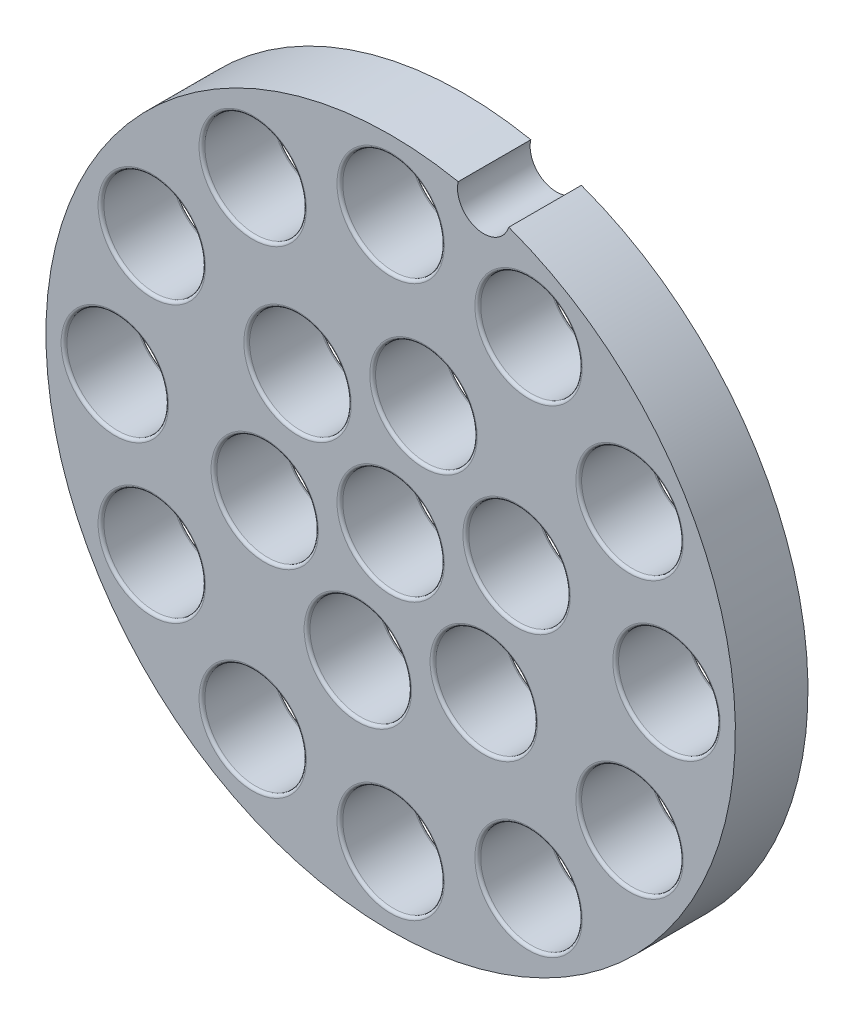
ISO-10303-21;
HEADER;
FILE_DESCRIPTION(('STEP AP214'),'2;1');
FILE_NAME('part.step','',(''),(''),'','','');
FILE_SCHEMA(('AUTOMOTIVE_DESIGN { 1 0 10303 214 1 1 1 1 }'));
ENDSEC;
DATA;
#1=APPLICATION_CONTEXT('core data for automotive mechanical design processes');
#2=APPLICATION_PROTOCOL_DEFINITION('international standard','automotive_design',2000,#1);
#3=PRODUCT_CONTEXT('',#1,'mechanical');
#4=PRODUCT('Part','Part','',(#3));
#5=PRODUCT_RELATED_PRODUCT_CATEGORY('part','',(#4));
#6=PRODUCT_DEFINITION_FORMATION('','',#4);
#7=PRODUCT_DEFINITION_CONTEXT('part definition',#1,'design');
#8=PRODUCT_DEFINITION('design','',#6,#7);
#9=PRODUCT_DEFINITION_SHAPE('','',#8);
#10=(LENGTH_UNIT() NAMED_UNIT(*) SI_UNIT(.MILLI.,.METRE.));
#11=(NAMED_UNIT(*) PLANE_ANGLE_UNIT() SI_UNIT($,.RADIAN.));
#12=(NAMED_UNIT(*) SI_UNIT($,.STERADIAN.) SOLID_ANGLE_UNIT());
#13=UNCERTAINTY_MEASURE_WITH_UNIT(LENGTH_MEASURE(1.E-05),#10,'distance_accuracy_value','');
#14=(GEOMETRIC_REPRESENTATION_CONTEXT(3) GLOBAL_UNCERTAINTY_ASSIGNED_CONTEXT((#13)) GLOBAL_UNIT_ASSIGNED_CONTEXT((#10,
#11,#12)) REPRESENTATION_CONTEXT('',''));
#15=CARTESIAN_POINT('',(0.,0.,0.));
#16=DIRECTION('',(0.,0.,1.));
#17=DIRECTION('',(1.,0.,0.));
#18=AXIS2_PLACEMENT_3D('',#15,#16,#17);
#19=CARTESIAN_POINT('',(0.,0.,5.));
#20=DIRECTION('',(0.,0.,1.));
#21=DIRECTION('',(1.,0.,0.));
#22=AXIS2_PLACEMENT_3D('',#19,#20,#21);
#23=PLANE('',#22);
#24=CARTESIAN_POINT('',(6.41463588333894,22.8636264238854,5.));
#25=DIRECTION('',(0.,0.,1.));
#26=DIRECTION('',(1.,0.,0.));
#27=AXIS2_PLACEMENT_3D('',#24,#25,#26);
#28=CIRCLE('',#27,1.80954769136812);
#29=CARTESIAN_POINT('',(4.65500103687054,23.2857023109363,5.));
#30=VERTEX_POINT('',#29);
#31=CARTESIAN_POINT('',(8.13702166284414,22.3087840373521,5.));
#32=VERTEX_POINT('',#31);
#33=EDGE_CURVE('E42',#30,#32,#28,.T.);
#34=ORIENTED_EDGE('',*,*,#33,.F.);
#35=CARTESIAN_POINT('',(0.,0.,5.));
#36=DIRECTION('',(0.,0.,1.));
#37=DIRECTION('',(1.,0.,0.));
#38=AXIS2_PLACEMENT_3D('',#35,#36,#37);
#39=CIRCLE('',#38,23.7464306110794);
#40=EDGE_CURVE('E60',#30,#32,#39,.T.);
#41=ORIENTED_EDGE('',*,*,#40,.T.);
#42=EDGE_LOOP('',(#34,#41));
#43=FACE_BOUND('',#42,.T.);
#44=CARTESIAN_POINT('',(0.,0.,5.));
#45=DIRECTION('',(0.,0.,1.));
#46=DIRECTION('',(1.,0.,0.));
#47=AXIS2_PLACEMENT_3D('',#44,#45,#46);
#48=CIRCLE('',#47,3.7);
#49=CARTESIAN_POINT('',(3.7,0.,5.));
#50=VERTEX_POINT('',#49);
#51=EDGE_CURVE('E185',#50,#50,#48,.F.);
#52=ORIENTED_EDGE('',*,*,#51,.T.);
#53=EDGE_LOOP('',(#52));
#54=FACE_BOUND('',#53,.T.);
#55=CARTESIAN_POINT('',(-6.4146358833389,6.31287941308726,5.));
#56=DIRECTION('',(0.,0.,1.));
#57=DIRECTION('',(1.,0.,0.));
#58=AXIS2_PLACEMENT_3D('',#55,#56,#57);
#59=CIRCLE('',#58,3.7);
#60=CARTESIAN_POINT('',(-2.7146358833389,6.31287941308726,5.));
#61=VERTEX_POINT('',#60);
#62=EDGE_CURVE('E188',#61,#61,#59,.F.);
#63=ORIENTED_EDGE('',*,*,#62,.T.);
#64=EDGE_LOOP('',(#63));
#65=FACE_BOUND('',#64,.T.);
#66=CARTESIAN_POINT('',(-8.67443188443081,-2.39879792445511,5.));
#67=DIRECTION('',(0.,0.,1.));
#68=DIRECTION('',(1.,0.,0.));
#69=AXIS2_PLACEMENT_3D('',#66,#67,#68);
#70=CIRCLE('',#69,3.7);
#71=CARTESIAN_POINT('',(-4.97443188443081,-2.39879792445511,5.));
#72=VERTEX_POINT('',#71);
#73=EDGE_CURVE('E191',#72,#72,#70,.F.);
#74=ORIENTED_EDGE('',*,*,#73,.T.);
#75=EDGE_LOOP('',(#74));
#76=FACE_BOUND('',#75,.T.);
#77=CARTESIAN_POINT('',(-2.25979600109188,-8.71167733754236,5.));
#78=DIRECTION('',(0.,0.,1.));
#79=DIRECTION('',(1.,0.,0.));
#80=AXIS2_PLACEMENT_3D('',#77,#78,#79);
#81=CIRCLE('',#80,3.7);
#82=CARTESIAN_POINT('',(1.44020399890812,-8.71167733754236,5.));
#83=VERTEX_POINT('',#82);
#84=EDGE_CURVE('E194',#83,#83,#81,.F.);
#85=ORIENTED_EDGE('',*,*,#84,.T.);
#86=EDGE_LOOP('',(#85));
#87=FACE_BOUND('',#86,.T.);
#88=CARTESIAN_POINT('',(6.41463588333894,-6.31287941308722,5.));
#89=DIRECTION('',(0.,0.,1.));
#90=DIRECTION('',(1.,0.,0.));
#91=AXIS2_PLACEMENT_3D('',#88,#89,#90);
#92=CIRCLE('',#91,3.7);
#93=CARTESIAN_POINT('',(10.1146358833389,-6.31287941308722,5.));
#94=VERTEX_POINT('',#93);
#95=EDGE_CURVE('E197',#94,#94,#92,.F.);
#96=ORIENTED_EDGE('',*,*,#95,.T.);
#97=EDGE_LOOP('',(#96));
#98=FACE_BOUND('',#97,.T.);
#99=CARTESIAN_POINT('',(8.67443188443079,2.39879792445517,5.));
#100=DIRECTION('',(0.,0.,1.));
#101=DIRECTION('',(1.,0.,0.));
#102=AXIS2_PLACEMENT_3D('',#99,#100,#101);
#103=CIRCLE('',#102,3.7);
#104=CARTESIAN_POINT('',(12.3744318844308,2.39879792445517,5.));
#105=VERTEX_POINT('',#104);
#106=EDGE_CURVE('E200',#105,#105,#103,.F.);
#107=ORIENTED_EDGE('',*,*,#106,.T.);
#108=EDGE_LOOP('',(#107));
#109=FACE_BOUND('',#108,.T.);
#110=CARTESIAN_POINT('',(2.25979600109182,8.71167733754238,5.));
#111=DIRECTION('',(0.,0.,1.));
#112=DIRECTION('',(1.,0.,0.));
#113=AXIS2_PLACEMENT_3D('',#110,#111,#112);
#114=CIRCLE('',#113,3.7);
#115=CARTESIAN_POINT('',(5.95979600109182,8.71167733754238,5.));
#116=VERTEX_POINT('',#115);
#117=EDGE_CURVE('E203',#116,#116,#114,.F.);
#118=ORIENTED_EDGE('',*,*,#117,.T.);
#119=EDGE_LOOP('',(#118));
#120=FACE_BOUND('',#119,.T.);
#121=CARTESIAN_POINT('',(-9.49999999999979,16.4544826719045,5.));
#122=DIRECTION('',(0.,0.,1.));
#123=DIRECTION('',(1.,0.,0.));
#124=AXIS2_PLACEMENT_3D('',#121,#122,#123);
#125=CIRCLE('',#124,3.7);
#126=CARTESIAN_POINT('',(-5.79999999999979,16.4544826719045,5.));
#127=VERTEX_POINT('',#126);
#128=EDGE_CURVE('E206',#127,#127,#125,.F.);
#129=ORIENTED_EDGE('',*,*,#128,.T.);
#130=EDGE_LOOP('',(#129));
#131=FACE_BOUND('',#130,.T.);
#132=CARTESIAN_POINT('',(-16.4544826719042,9.50000000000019,5.));
#133=DIRECTION('',(0.,0.,1.));
#134=DIRECTION('',(1.,0.,0.));
#135=AXIS2_PLACEMENT_3D('',#132,#133,#134);
#136=CIRCLE('',#135,3.7);
#137=CARTESIAN_POINT('',(-12.7544826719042,9.50000000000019,5.));
#138=VERTEX_POINT('',#137);
#139=EDGE_CURVE('E209',#138,#138,#136,.F.);
#140=ORIENTED_EDGE('',*,*,#139,.T.);
#141=EDGE_LOOP('',(#140));
#142=FACE_BOUND('',#141,.T.);
#143=CARTESIAN_POINT('',(-19.,1.99014551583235E-13,5.));
#144=DIRECTION('',(0.,0.,1.));
#145=DIRECTION('',(1.,0.,0.));
#146=AXIS2_PLACEMENT_3D('',#143,#144,#145);
#147=CIRCLE('',#146,3.7);
#148=CARTESIAN_POINT('',(-15.3,1.99014551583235E-13,5.));
#149=VERTEX_POINT('',#148);
#150=EDGE_CURVE('E212',#149,#149,#147,.F.);
#151=ORIENTED_EDGE('',*,*,#150,.T.);
#152=EDGE_LOOP('',(#151));
#153=FACE_BOUND('',#152,.T.);
#154=CARTESIAN_POINT('',(-16.4544826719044,-9.49999999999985,5.));
#155=DIRECTION('',(0.,0.,1.));
#156=DIRECTION('',(1.,0.,0.));
#157=AXIS2_PLACEMENT_3D('',#154,#155,#156);
#158=CIRCLE('',#157,3.7);
#159=CARTESIAN_POINT('',(-12.7544826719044,-9.49999999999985,5.));
#160=VERTEX_POINT('',#159);
#161=EDGE_CURVE('E215',#160,#160,#158,.F.);
#162=ORIENTED_EDGE('',*,*,#161,.T.);
#163=EDGE_LOOP('',(#162));
#164=FACE_BOUND('',#163,.T.);
#165=CARTESIAN_POINT('',(-9.50000000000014,-16.4544826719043,5.));
#166=DIRECTION('',(0.,0.,1.));
#167=DIRECTION('',(1.,0.,0.));
#168=AXIS2_PLACEMENT_3D('',#165,#166,#167);
#169=CIRCLE('',#168,3.7);
#170=CARTESIAN_POINT('',(-5.80000000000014,-16.4544826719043,5.));
#171=VERTEX_POINT('',#170);
#172=EDGE_CURVE('E218',#171,#171,#169,.F.);
#173=ORIENTED_EDGE('',*,*,#172,.T.);
#174=EDGE_LOOP('',(#173));
#175=FACE_BOUND('',#174,.T.);
#176=CARTESIAN_POINT('',(-1.32676367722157E-13,-19.,5.));
#177=DIRECTION('',(0.,0.,1.));
#178=DIRECTION('',(1.,0.,0.));
#179=AXIS2_PLACEMENT_3D('',#176,#177,#178);
#180=CIRCLE('',#179,3.7);
#181=CARTESIAN_POINT('',(3.69999999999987,-19.,5.));
#182=VERTEX_POINT('',#181);
#183=EDGE_CURVE('E221',#182,#182,#180,.F.);
#184=ORIENTED_EDGE('',*,*,#183,.T.);
#185=EDGE_LOOP('',(#184));
#186=FACE_BOUND('',#185,.T.);
#187=CARTESIAN_POINT('',(9.4999999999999,-16.4544826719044,5.));
#188=DIRECTION('',(0.,0.,1.));
#189=DIRECTION('',(1.,0.,0.));
#190=AXIS2_PLACEMENT_3D('',#187,#188,#189);
#191=CIRCLE('',#190,3.7);
#192=CARTESIAN_POINT('',(13.1999999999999,-16.4544826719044,5.));
#193=VERTEX_POINT('',#192);
#194=EDGE_CURVE('E224',#193,#193,#191,.F.);
#195=ORIENTED_EDGE('',*,*,#194,.T.);
#196=EDGE_LOOP('',(#195));
#197=FACE_BOUND('',#196,.T.);
#198=CARTESIAN_POINT('',(16.4544826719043,-9.50000000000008,5.));
#199=DIRECTION('',(0.,0.,1.));
#200=DIRECTION('',(1.,0.,0.));
#201=AXIS2_PLACEMENT_3D('',#198,#199,#200);
#202=CIRCLE('',#201,3.7);
#203=CARTESIAN_POINT('',(20.1544826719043,-9.50000000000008,5.));
#204=VERTEX_POINT('',#203);
#205=EDGE_CURVE('E227',#204,#204,#202,.F.);
#206=ORIENTED_EDGE('',*,*,#205,.T.);
#207=EDGE_LOOP('',(#206));
#208=FACE_BOUND('',#207,.T.);
#209=CARTESIAN_POINT('',(19.,0.,5.));
#210=DIRECTION('',(0.,0.,1.));
#211=DIRECTION('',(1.,0.,0.));
#212=AXIS2_PLACEMENT_3D('',#209,#210,#211);
#213=CIRCLE('',#212,3.7);
#214=CARTESIAN_POINT('',(22.7,0.,5.));
#215=VERTEX_POINT('',#214);
#216=EDGE_CURVE('E230',#215,#215,#213,.F.);
#217=ORIENTED_EDGE('',*,*,#216,.T.);
#218=EDGE_LOOP('',(#217));
#219=FACE_BOUND('',#218,.T.);
#220=CARTESIAN_POINT('',(16.4544826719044,9.49999999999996,5.));
#221=DIRECTION('',(0.,0.,1.));
#222=DIRECTION('',(1.,0.,0.));
#223=AXIS2_PLACEMENT_3D('',#220,#221,#222);
#224=CIRCLE('',#223,3.7);
#225=CARTESIAN_POINT('',(20.1544826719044,9.49999999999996,5.));
#226=VERTEX_POINT('',#225);
#227=EDGE_CURVE('E233',#226,#226,#224,.F.);
#228=ORIENTED_EDGE('',*,*,#227,.T.);
#229=EDGE_LOOP('',(#228));
#230=FACE_BOUND('',#229,.T.);
#231=CARTESIAN_POINT('',(9.50000000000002,16.4544826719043,5.));
#232=DIRECTION('',(0.,0.,1.));
#233=DIRECTION('',(1.,0.,0.));
#234=AXIS2_PLACEMENT_3D('',#231,#232,#233);
#235=CIRCLE('',#234,3.7);
#236=CARTESIAN_POINT('',(13.2,16.4544826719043,5.));
#237=VERTEX_POINT('',#236);
#238=EDGE_CURVE('E236',#237,#237,#235,.F.);
#239=ORIENTED_EDGE('',*,*,#238,.T.);
#240=EDGE_LOOP('',(#239));
#241=FACE_BOUND('',#240,.T.);
#242=CARTESIAN_POINT('',(0.,19.,5.));
#243=DIRECTION('',(0.,0.,1.));
#244=DIRECTION('',(1.,0.,0.));
#245=AXIS2_PLACEMENT_3D('',#242,#243,#244);
#246=CIRCLE('',#245,3.7);
#247=CARTESIAN_POINT('',(3.7,19.,5.));
#248=VERTEX_POINT('',#247);
#249=EDGE_CURVE('E239',#248,#248,#246,.F.);
#250=ORIENTED_EDGE('',*,*,#249,.T.);
#251=EDGE_LOOP('',(#250));
#252=FACE_BOUND('',#251,.T.);
#253=ADVANCED_FACE('F29',(#43,#54,#65,#76,#87,#98,#109,#120,#131,#142,#153,#164,#175,#186,#197,
#208,#219,#230,#241,#252),#23,.T.);
#254=CARTESIAN_POINT('',(0.,0.,0.));
#255=DIRECTION('',(0.,0.,1.));
#256=DIRECTION('',(1.,0.,0.));
#257=AXIS2_PLACEMENT_3D('',#254,#255,#256);
#258=PLANE('',#257);
#259=CARTESIAN_POINT('',(0.,0.,0.));
#260=DIRECTION('',(0.,0.,1.));
#261=DIRECTION('',(1.,0.,0.));
#262=AXIS2_PLACEMENT_3D('',#259,#260,#261);
#263=CIRCLE('',#262,3.7);
#264=CARTESIAN_POINT('',(3.7,0.,0.));
#265=VERTEX_POINT('',#264);
#266=EDGE_CURVE('E65',#265,#265,#263,.T.);
#267=ORIENTED_EDGE('',*,*,#266,.T.);
#268=EDGE_LOOP('',(#267));
#269=FACE_BOUND('',#268,.T.);
#270=CARTESIAN_POINT('',(-6.4146358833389,6.31287941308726,0.));
#271=DIRECTION('',(0.,0.,1.));
#272=DIRECTION('',(1.,0.,0.));
#273=AXIS2_PLACEMENT_3D('',#270,#271,#272);
#274=CIRCLE('',#273,3.7);
#275=CARTESIAN_POINT('',(-2.7146358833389,6.31287941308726,0.));
#276=VERTEX_POINT('',#275);
#277=EDGE_CURVE('E71',#276,#276,#274,.T.);
#278=ORIENTED_EDGE('',*,*,#277,.T.);
#279=EDGE_LOOP('',(#278));
#280=FACE_BOUND('',#279,.T.);
#281=CARTESIAN_POINT('',(-8.67443188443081,-2.39879792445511,0.));
#282=DIRECTION('',(0.,0.,1.));
#283=DIRECTION('',(1.,0.,0.));
#284=AXIS2_PLACEMENT_3D('',#281,#282,#283);
#285=CIRCLE('',#284,3.7);
#286=CARTESIAN_POINT('',(-4.97443188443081,-2.39879792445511,0.));
#287=VERTEX_POINT('',#286);
#288=EDGE_CURVE('E74',#287,#287,#285,.T.);
#289=ORIENTED_EDGE('',*,*,#288,.T.);
#290=EDGE_LOOP('',(#289));
#291=FACE_BOUND('',#290,.T.);
#292=CARTESIAN_POINT('',(-2.25979600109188,-8.71167733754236,0.));
#293=DIRECTION('',(0.,0.,1.));
#294=DIRECTION('',(1.,0.,0.));
#295=AXIS2_PLACEMENT_3D('',#292,#293,#294);
#296=CIRCLE('',#295,3.7);
#297=CARTESIAN_POINT('',(1.44020399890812,-8.71167733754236,0.));
#298=VERTEX_POINT('',#297);
#299=EDGE_CURVE('E77',#298,#298,#296,.T.);
#300=ORIENTED_EDGE('',*,*,#299,.T.);
#301=EDGE_LOOP('',(#300));
#302=FACE_BOUND('',#301,.T.);
#303=CARTESIAN_POINT('',(6.41463588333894,-6.31287941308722,0.));
#304=DIRECTION('',(0.,0.,1.));
#305=DIRECTION('',(1.,0.,0.));
#306=AXIS2_PLACEMENT_3D('',#303,#304,#305);
#307=CIRCLE('',#306,3.7);
#308=CARTESIAN_POINT('',(10.1146358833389,-6.31287941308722,0.));
#309=VERTEX_POINT('',#308);
#310=EDGE_CURVE('E80',#309,#309,#307,.T.);
#311=ORIENTED_EDGE('',*,*,#310,.T.);
#312=EDGE_LOOP('',(#311));
#313=FACE_BOUND('',#312,.T.);
#314=CARTESIAN_POINT('',(8.67443188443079,2.39879792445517,0.));
#315=DIRECTION('',(0.,0.,1.));
#316=DIRECTION('',(1.,0.,0.));
#317=AXIS2_PLACEMENT_3D('',#314,#315,#316);
#318=CIRCLE('',#317,3.7);
#319=CARTESIAN_POINT('',(12.3744318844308,2.39879792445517,0.));
#320=VERTEX_POINT('',#319);
#321=EDGE_CURVE('E83',#320,#320,#318,.T.);
#322=ORIENTED_EDGE('',*,*,#321,.T.);
#323=EDGE_LOOP('',(#322));
#324=FACE_BOUND('',#323,.T.);
#325=CARTESIAN_POINT('',(2.25979600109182,8.71167733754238,0.));
#326=DIRECTION('',(0.,0.,1.));
#327=DIRECTION('',(1.,0.,0.));
#328=AXIS2_PLACEMENT_3D('',#325,#326,#327);
#329=CIRCLE('',#328,3.7);
#330=CARTESIAN_POINT('',(5.95979600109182,8.71167733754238,0.));
#331=VERTEX_POINT('',#330);
#332=EDGE_CURVE('E86',#331,#331,#329,.T.);
#333=ORIENTED_EDGE('',*,*,#332,.T.);
#334=EDGE_LOOP('',(#333));
#335=FACE_BOUND('',#334,.T.);
#336=CARTESIAN_POINT('',(-9.49999999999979,16.4544826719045,0.));
#337=DIRECTION('',(0.,0.,1.));
#338=DIRECTION('',(1.,0.,0.));
#339=AXIS2_PLACEMENT_3D('',#336,#337,#338);
#340=CIRCLE('',#339,3.7);
#341=CARTESIAN_POINT('',(-5.79999999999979,16.4544826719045,0.));
#342=VERTEX_POINT('',#341);
#343=EDGE_CURVE('E89',#342,#342,#340,.T.);
#344=ORIENTED_EDGE('',*,*,#343,.T.);
#345=EDGE_LOOP('',(#344));
#346=FACE_BOUND('',#345,.T.);
#347=CARTESIAN_POINT('',(-16.4544826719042,9.50000000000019,0.));
#348=DIRECTION('',(0.,0.,1.));
#349=DIRECTION('',(1.,0.,0.));
#350=AXIS2_PLACEMENT_3D('',#347,#348,#349);
#351=CIRCLE('',#350,3.7);
#352=CARTESIAN_POINT('',(-12.7544826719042,9.50000000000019,0.));
#353=VERTEX_POINT('',#352);
#354=EDGE_CURVE('E92',#353,#353,#351,.T.);
#355=ORIENTED_EDGE('',*,*,#354,.T.);
#356=EDGE_LOOP('',(#355));
#357=FACE_BOUND('',#356,.T.);
#358=CARTESIAN_POINT('',(-19.,1.99014551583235E-13,0.));
#359=DIRECTION('',(0.,0.,1.));
#360=DIRECTION('',(1.,0.,0.));
#361=AXIS2_PLACEMENT_3D('',#358,#359,#360);
#362=CIRCLE('',#361,3.7);
#363=CARTESIAN_POINT('',(-15.3,1.99014551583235E-13,0.));
#364=VERTEX_POINT('',#363);
#365=EDGE_CURVE('E95',#364,#364,#362,.T.);
#366=ORIENTED_EDGE('',*,*,#365,.T.);
#367=EDGE_LOOP('',(#366));
#368=FACE_BOUND('',#367,.T.);
#369=CARTESIAN_POINT('',(-16.4544826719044,-9.49999999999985,0.));
#370=DIRECTION('',(0.,0.,1.));
#371=DIRECTION('',(1.,0.,0.));
#372=AXIS2_PLACEMENT_3D('',#369,#370,#371);
#373=CIRCLE('',#372,3.7);
#374=CARTESIAN_POINT('',(-12.7544826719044,-9.49999999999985,0.));
#375=VERTEX_POINT('',#374);
#376=EDGE_CURVE('E98',#375,#375,#373,.T.);
#377=ORIENTED_EDGE('',*,*,#376,.T.);
#378=EDGE_LOOP('',(#377));
#379=FACE_BOUND('',#378,.T.);
#380=CARTESIAN_POINT('',(-9.50000000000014,-16.4544826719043,0.));
#381=DIRECTION('',(0.,0.,1.));
#382=DIRECTION('',(1.,0.,0.));
#383=AXIS2_PLACEMENT_3D('',#380,#381,#382);
#384=CIRCLE('',#383,3.7);
#385=CARTESIAN_POINT('',(-5.80000000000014,-16.4544826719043,0.));
#386=VERTEX_POINT('',#385);
#387=EDGE_CURVE('E101',#386,#386,#384,.T.);
#388=ORIENTED_EDGE('',*,*,#387,.T.);
#389=EDGE_LOOP('',(#388));
#390=FACE_BOUND('',#389,.T.);
#391=CARTESIAN_POINT('',(-1.32676367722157E-13,-19.,0.));
#392=DIRECTION('',(0.,0.,1.));
#393=DIRECTION('',(1.,0.,0.));
#394=AXIS2_PLACEMENT_3D('',#391,#392,#393);
#395=CIRCLE('',#394,3.7);
#396=CARTESIAN_POINT('',(3.69999999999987,-19.,0.));
#397=VERTEX_POINT('',#396);
#398=EDGE_CURVE('E104',#397,#397,#395,.T.);
#399=ORIENTED_EDGE('',*,*,#398,.T.);
#400=EDGE_LOOP('',(#399));
#401=FACE_BOUND('',#400,.T.);
#402=CARTESIAN_POINT('',(9.4999999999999,-16.4544826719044,0.));
#403=DIRECTION('',(0.,0.,1.));
#404=DIRECTION('',(1.,0.,0.));
#405=AXIS2_PLACEMENT_3D('',#402,#403,#404);
#406=CIRCLE('',#405,3.7);
#407=CARTESIAN_POINT('',(13.1999999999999,-16.4544826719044,0.));
#408=VERTEX_POINT('',#407);
#409=EDGE_CURVE('E107',#408,#408,#406,.T.);
#410=ORIENTED_EDGE('',*,*,#409,.T.);
#411=EDGE_LOOP('',(#410));
#412=FACE_BOUND('',#411,.T.);
#413=CARTESIAN_POINT('',(16.4544826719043,-9.50000000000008,0.));
#414=DIRECTION('',(0.,0.,1.));
#415=DIRECTION('',(1.,0.,0.));
#416=AXIS2_PLACEMENT_3D('',#413,#414,#415);
#417=CIRCLE('',#416,3.7);
#418=CARTESIAN_POINT('',(20.1544826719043,-9.50000000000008,0.));
#419=VERTEX_POINT('',#418);
#420=EDGE_CURVE('E110',#419,#419,#417,.T.);
#421=ORIENTED_EDGE('',*,*,#420,.T.);
#422=EDGE_LOOP('',(#421));
#423=FACE_BOUND('',#422,.T.);
#424=CARTESIAN_POINT('',(19.,0.,0.));
#425=DIRECTION('',(0.,0.,1.));
#426=DIRECTION('',(1.,0.,0.));
#427=AXIS2_PLACEMENT_3D('',#424,#425,#426);
#428=CIRCLE('',#427,3.7);
#429=CARTESIAN_POINT('',(22.7,0.,0.));
#430=VERTEX_POINT('',#429);
#431=EDGE_CURVE('E113',#430,#430,#428,.T.);
#432=ORIENTED_EDGE('',*,*,#431,.T.);
#433=EDGE_LOOP('',(#432));
#434=FACE_BOUND('',#433,.T.);
#435=CARTESIAN_POINT('',(16.4544826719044,9.49999999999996,0.));
#436=DIRECTION('',(0.,0.,1.));
#437=DIRECTION('',(1.,0.,0.));
#438=AXIS2_PLACEMENT_3D('',#435,#436,#437);
#439=CIRCLE('',#438,3.7);
#440=CARTESIAN_POINT('',(20.1544826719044,9.49999999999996,0.));
#441=VERTEX_POINT('',#440);
#442=EDGE_CURVE('E116',#441,#441,#439,.T.);
#443=ORIENTED_EDGE('',*,*,#442,.T.);
#444=EDGE_LOOP('',(#443));
#445=FACE_BOUND('',#444,.T.);
#446=CARTESIAN_POINT('',(9.50000000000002,16.4544826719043,0.));
#447=DIRECTION('',(0.,0.,1.));
#448=DIRECTION('',(1.,0.,0.));
#449=AXIS2_PLACEMENT_3D('',#446,#447,#448);
#450=CIRCLE('',#449,3.7);
#451=CARTESIAN_POINT('',(13.2,16.4544826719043,0.));
#452=VERTEX_POINT('',#451);
#453=EDGE_CURVE('E119',#452,#452,#450,.T.);
#454=ORIENTED_EDGE('',*,*,#453,.T.);
#455=EDGE_LOOP('',(#454));
#456=FACE_BOUND('',#455,.T.);
#457=CARTESIAN_POINT('',(0.,19.,0.));
#458=DIRECTION('',(0.,0.,1.));
#459=DIRECTION('',(1.,0.,0.));
#460=AXIS2_PLACEMENT_3D('',#457,#458,#459);
#461=CIRCLE('',#460,3.7);
#462=CARTESIAN_POINT('',(3.7,19.,0.));
#463=VERTEX_POINT('',#462);
#464=EDGE_CURVE('E122',#463,#463,#461,.T.);
#465=ORIENTED_EDGE('',*,*,#464,.T.);
#466=EDGE_LOOP('',(#465));
#467=FACE_BOUND('',#466,.T.);
#468=CARTESIAN_POINT('',(0.,0.,0.));
#469=DIRECTION('',(0.,0.,1.));
#470=DIRECTION('',(1.,0.,0.));
#471=AXIS2_PLACEMENT_3D('',#468,#469,#470);
#472=CIRCLE('',#471,23.7464306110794);
#473=CARTESIAN_POINT('',(4.65500103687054,23.2857023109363,0.));
#474=VERTEX_POINT('',#473);
#475=CARTESIAN_POINT('',(8.13702166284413,22.3087840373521,0.));
#476=VERTEX_POINT('',#475);
#477=EDGE_CURVE('E63',#474,#476,#472,.T.);
#478=ORIENTED_EDGE('',*,*,#477,.F.);
#479=CARTESIAN_POINT('',(6.41463588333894,22.8636264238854,0.));
#480=DIRECTION('',(0.,0.,1.));
#481=DIRECTION('',(1.,0.,0.));
#482=AXIS2_PLACEMENT_3D('',#479,#480,#481);
#483=CIRCLE('',#482,1.80954769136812);
#484=EDGE_CURVE('E52',#474,#476,#483,.T.);
#485=ORIENTED_EDGE('',*,*,#484,.T.);
#486=EDGE_LOOP('',(#478,#485));
#487=FACE_BOUND('',#486,.T.);
#488=ADVANCED_FACE('F315',(#269,#280,#291,#302,#313,#324,#335,#346,#357,#368,#379,#390,#401,
#412,#423,#434,#445,#456,#467,#487),#258,.F.);
#489=CARTESIAN_POINT('',(0.,19.,0.));
#490=DIRECTION('',(0.,0.,1.));
#491=DIRECTION('',(1.,0.,0.));
#492=AXIS2_PLACEMENT_3D('',#489,#490,#491);
#493=CYLINDRICAL_SURFACE('',#492,3.5);
#494=CARTESIAN_POINT('',(0.,19.,4.8));
#495=DIRECTION('',(0.,0.,1.));
#496=DIRECTION('',(1.,0.,0.));
#497=AXIS2_PLACEMENT_3D('',#494,#495,#496);
#498=CIRCLE('',#497,3.5);
#499=CARTESIAN_POINT('',(3.5,19.,4.8));
#500=VERTEX_POINT('',#499);
#501=EDGE_CURVE('E182',#500,#500,#498,.T.);
#502=ORIENTED_EDGE('',*,*,#501,.T.);
#503=EDGE_LOOP('',(#502));
#504=FACE_BOUND('',#503,.T.);
#505=CARTESIAN_POINT('',(0.,19.,0.2));
#506=DIRECTION('',(0.,0.,1.));
#507=DIRECTION('',(1.,0.,0.));
#508=AXIS2_PLACEMENT_3D('',#505,#506,#507);
#509=CIRCLE('',#508,3.5);
#510=CARTESIAN_POINT('',(3.5,19.,0.2));
#511=VERTEX_POINT('',#510);
#512=EDGE_CURVE('E125',#511,#511,#509,.F.);
#513=ORIENTED_EDGE('',*,*,#512,.T.);
#514=EDGE_LOOP('',(#513));
#515=FACE_BOUND('',#514,.T.);
#516=ADVANCED_FACE('F319',(#504,#515),#493,.F.);
#517=CARTESIAN_POINT('',(9.50000000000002,16.4544826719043,0.));
#518=DIRECTION('',(0.,0.,1.));
#519=DIRECTION('',(1.,0.,0.));
#520=AXIS2_PLACEMENT_3D('',#517,#518,#519);
#521=CYLINDRICAL_SURFACE('',#520,3.5);
#522=CARTESIAN_POINT('',(9.50000000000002,16.4544826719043,4.8));
#523=DIRECTION('',(0.,0.,1.));
#524=DIRECTION('',(1.,0.,0.));
#525=AXIS2_PLACEMENT_3D('',#522,#523,#524);
#526=CIRCLE('',#525,3.5);
#527=CARTESIAN_POINT('',(13.,16.4544826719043,4.8));
#528=VERTEX_POINT('',#527);
#529=EDGE_CURVE('E242',#528,#528,#526,.T.);
#530=ORIENTED_EDGE('',*,*,#529,.T.);
#531=EDGE_LOOP('',(#530));
#532=FACE_BOUND('',#531,.T.);
#533=CARTESIAN_POINT('',(9.50000000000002,16.4544826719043,0.2));
#534=DIRECTION('',(0.,0.,1.));
#535=DIRECTION('',(1.,0.,0.));
#536=AXIS2_PLACEMENT_3D('',#533,#534,#535);
#537=CIRCLE('',#536,3.5);
#538=CARTESIAN_POINT('',(13.,16.4544826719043,0.2));
#539=VERTEX_POINT('',#538);
#540=EDGE_CURVE('E128',#539,#539,#537,.F.);
#541=ORIENTED_EDGE('',*,*,#540,.T.);
#542=EDGE_LOOP('',(#541));
#543=FACE_BOUND('',#542,.T.);
#544=ADVANCED_FACE('F324',(#532,#543),#521,.F.);
#545=CARTESIAN_POINT('',(16.4544826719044,9.49999999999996,0.));
#546=DIRECTION('',(0.,0.,1.));
#547=DIRECTION('',(1.,0.,0.));
#548=AXIS2_PLACEMENT_3D('',#545,#546,#547);
#549=CYLINDRICAL_SURFACE('',#548,3.5);
#550=CARTESIAN_POINT('',(16.4544826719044,9.49999999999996,4.8));
#551=DIRECTION('',(0.,0.,1.));
#552=DIRECTION('',(1.,0.,0.));
#553=AXIS2_PLACEMENT_3D('',#550,#551,#552);
#554=CIRCLE('',#553,3.5);
#555=CARTESIAN_POINT('',(19.9544826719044,9.49999999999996,4.8));
#556=VERTEX_POINT('',#555);
#557=EDGE_CURVE('E245',#556,#556,#554,.T.);
#558=ORIENTED_EDGE('',*,*,#557,.T.);
#559=EDGE_LOOP('',(#558));
#560=FACE_BOUND('',#559,.T.);
#561=CARTESIAN_POINT('',(16.4544826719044,9.49999999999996,0.2));
#562=DIRECTION('',(0.,0.,1.));
#563=DIRECTION('',(1.,0.,0.));
#564=AXIS2_PLACEMENT_3D('',#561,#562,#563);
#565=CIRCLE('',#564,3.5);
#566=CARTESIAN_POINT('',(19.9544826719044,9.49999999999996,0.2));
#567=VERTEX_POINT('',#566);
#568=EDGE_CURVE('E131',#567,#567,#565,.F.);
#569=ORIENTED_EDGE('',*,*,#568,.T.);
#570=EDGE_LOOP('',(#569));
#571=FACE_BOUND('',#570,.T.);
#572=ADVANCED_FACE('F331',(#560,#571),#549,.F.);
#573=CARTESIAN_POINT('',(19.,0.,0.));
#574=DIRECTION('',(0.,0.,1.));
#575=DIRECTION('',(1.,0.,0.));
#576=AXIS2_PLACEMENT_3D('',#573,#574,#575);
#577=CYLINDRICAL_SURFACE('',#576,3.5);
#578=CARTESIAN_POINT('',(19.,0.,4.8));
#579=DIRECTION('',(0.,0.,1.));
#580=DIRECTION('',(1.,0.,0.));
#581=AXIS2_PLACEMENT_3D('',#578,#579,#580);
#582=CIRCLE('',#581,3.5);
#583=CARTESIAN_POINT('',(22.5,0.,4.8));
#584=VERTEX_POINT('',#583);
#585=EDGE_CURVE('E248',#584,#584,#582,.T.);
#586=ORIENTED_EDGE('',*,*,#585,.T.);
#587=EDGE_LOOP('',(#586));
#588=FACE_BOUND('',#587,.T.);
#589=CARTESIAN_POINT('',(19.,0.,0.2));
#590=DIRECTION('',(0.,0.,1.));
#591=DIRECTION('',(1.,0.,0.));
#592=AXIS2_PLACEMENT_3D('',#589,#590,#591);
#593=CIRCLE('',#592,3.5);
#594=CARTESIAN_POINT('',(22.5,0.,0.2));
#595=VERTEX_POINT('',#594);
#596=EDGE_CURVE('E134',#595,#595,#593,.F.);
#597=ORIENTED_EDGE('',*,*,#596,.T.);
#598=EDGE_LOOP('',(#597));
#599=FACE_BOUND('',#598,.T.);
#600=ADVANCED_FACE('F335',(#588,#599),#577,.F.);
#601=CARTESIAN_POINT('',(16.4544826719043,-9.50000000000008,0.));
#602=DIRECTION('',(0.,0.,1.));
#603=DIRECTION('',(1.,0.,0.));
#604=AXIS2_PLACEMENT_3D('',#601,#602,#603);
#605=CYLINDRICAL_SURFACE('',#604,3.5);
#606=CARTESIAN_POINT('',(16.4544826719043,-9.50000000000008,4.8));
#607=DIRECTION('',(0.,0.,1.));
#608=DIRECTION('',(1.,0.,0.));
#609=AXIS2_PLACEMENT_3D('',#606,#607,#608);
#610=CIRCLE('',#609,3.5);
#611=CARTESIAN_POINT('',(19.9544826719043,-9.50000000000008,4.8));
#612=VERTEX_POINT('',#611);
#613=EDGE_CURVE('E251',#612,#612,#610,.T.);
#614=ORIENTED_EDGE('',*,*,#613,.T.);
#615=EDGE_LOOP('',(#614));
#616=FACE_BOUND('',#615,.T.);
#617=CARTESIAN_POINT('',(16.4544826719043,-9.50000000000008,0.2));
#618=DIRECTION('',(0.,0.,1.));
#619=DIRECTION('',(1.,0.,0.));
#620=AXIS2_PLACEMENT_3D('',#617,#618,#619);
#621=CIRCLE('',#620,3.5);
#622=CARTESIAN_POINT('',(19.9544826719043,-9.50000000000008,0.2));
#623=VERTEX_POINT('',#622);
#624=EDGE_CURVE('E137',#623,#623,#621,.F.);
#625=ORIENTED_EDGE('',*,*,#624,.T.);
#626=EDGE_LOOP('',(#625));
#627=FACE_BOUND('',#626,.T.);
#628=ADVANCED_FACE('F339',(#616,#627),#605,.F.);
#629=CARTESIAN_POINT('',(9.4999999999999,-16.4544826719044,0.));
#630=DIRECTION('',(0.,0.,1.));
#631=DIRECTION('',(1.,0.,0.));
#632=AXIS2_PLACEMENT_3D('',#629,#630,#631);
#633=CYLINDRICAL_SURFACE('',#632,3.5);
#634=CARTESIAN_POINT('',(9.4999999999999,-16.4544826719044,4.8));
#635=DIRECTION('',(0.,0.,1.));
#636=DIRECTION('',(1.,0.,0.));
#637=AXIS2_PLACEMENT_3D('',#634,#635,#636);
#638=CIRCLE('',#637,3.5);
#639=CARTESIAN_POINT('',(12.9999999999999,-16.4544826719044,4.8));
#640=VERTEX_POINT('',#639);
#641=EDGE_CURVE('E254',#640,#640,#638,.T.);
#642=ORIENTED_EDGE('',*,*,#641,.T.);
#643=EDGE_LOOP('',(#642));
#644=FACE_BOUND('',#643,.T.);
#645=CARTESIAN_POINT('',(9.4999999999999,-16.4544826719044,0.2));
#646=DIRECTION('',(0.,0.,1.));
#647=DIRECTION('',(1.,0.,0.));
#648=AXIS2_PLACEMENT_3D('',#645,#646,#647);
#649=CIRCLE('',#648,3.5);
#650=CARTESIAN_POINT('',(12.9999999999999,-16.4544826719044,0.2));
#651=VERTEX_POINT('',#650);
#652=EDGE_CURVE('E140',#651,#651,#649,.F.);
#653=ORIENTED_EDGE('',*,*,#652,.T.);
#654=EDGE_LOOP('',(#653));
#655=FACE_BOUND('',#654,.T.);
#656=ADVANCED_FACE('F343',(#644,#655),#633,.F.);
#657=CARTESIAN_POINT('',(-1.32676367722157E-13,-19.,0.));
#658=DIRECTION('',(0.,0.,1.));
#659=DIRECTION('',(1.,0.,0.));
#660=AXIS2_PLACEMENT_3D('',#657,#658,#659);
#661=CYLINDRICAL_SURFACE('',#660,3.5);
#662=CARTESIAN_POINT('',(-1.32676367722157E-13,-19.,4.8));
#663=DIRECTION('',(0.,0.,1.));
#664=DIRECTION('',(1.,0.,0.));
#665=AXIS2_PLACEMENT_3D('',#662,#663,#664);
#666=CIRCLE('',#665,3.5);
#667=CARTESIAN_POINT('',(3.49999999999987,-19.,4.8));
#668=VERTEX_POINT('',#667);
#669=EDGE_CURVE('E257',#668,#668,#666,.T.);
#670=ORIENTED_EDGE('',*,*,#669,.T.);
#671=EDGE_LOOP('',(#670));
#672=FACE_BOUND('',#671,.T.);
#673=CARTESIAN_POINT('',(-1.32676367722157E-13,-19.,0.2));
#674=DIRECTION('',(0.,0.,1.));
#675=DIRECTION('',(1.,0.,0.));
#676=AXIS2_PLACEMENT_3D('',#673,#674,#675);
#677=CIRCLE('',#676,3.5);
#678=CARTESIAN_POINT('',(3.49999999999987,-19.,0.2));
#679=VERTEX_POINT('',#678);
#680=EDGE_CURVE('E143',#679,#679,#677,.F.);
#681=ORIENTED_EDGE('',*,*,#680,.T.);
#682=EDGE_LOOP('',(#681));
#683=FACE_BOUND('',#682,.T.);
#684=ADVANCED_FACE('F347',(#672,#683),#661,.F.);
#685=CARTESIAN_POINT('',(-9.50000000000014,-16.4544826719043,0.));
#686=DIRECTION('',(0.,0.,1.));
#687=DIRECTION('',(1.,0.,0.));
#688=AXIS2_PLACEMENT_3D('',#685,#686,#687);
#689=CYLINDRICAL_SURFACE('',#688,3.5);
#690=CARTESIAN_POINT('',(-9.50000000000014,-16.4544826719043,4.8));
#691=DIRECTION('',(0.,0.,1.));
#692=DIRECTION('',(1.,0.,0.));
#693=AXIS2_PLACEMENT_3D('',#690,#691,#692);
#694=CIRCLE('',#693,3.5);
#695=CARTESIAN_POINT('',(-6.00000000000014,-16.4544826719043,4.8));
#696=VERTEX_POINT('',#695);
#697=EDGE_CURVE('E260',#696,#696,#694,.T.);
#698=ORIENTED_EDGE('',*,*,#697,.T.);
#699=EDGE_LOOP('',(#698));
#700=FACE_BOUND('',#699,.T.);
#701=CARTESIAN_POINT('',(-9.50000000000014,-16.4544826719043,0.2));
#702=DIRECTION('',(0.,0.,1.));
#703=DIRECTION('',(1.,0.,0.));
#704=AXIS2_PLACEMENT_3D('',#701,#702,#703);
#705=CIRCLE('',#704,3.5);
#706=CARTESIAN_POINT('',(-6.00000000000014,-16.4544826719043,0.2));
#707=VERTEX_POINT('',#706);
#708=EDGE_CURVE('E146',#707,#707,#705,.F.);
#709=ORIENTED_EDGE('',*,*,#708,.T.);
#710=EDGE_LOOP('',(#709));
#711=FACE_BOUND('',#710,.T.);
#712=ADVANCED_FACE('F351',(#700,#711),#689,.F.);
#713=CARTESIAN_POINT('',(-16.4544826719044,-9.49999999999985,0.));
#714=DIRECTION('',(0.,0.,1.));
#715=DIRECTION('',(1.,0.,0.));
#716=AXIS2_PLACEMENT_3D('',#713,#714,#715);
#717=CYLINDRICAL_SURFACE('',#716,3.5);
#718=CARTESIAN_POINT('',(-16.4544826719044,-9.49999999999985,4.8));
#719=DIRECTION('',(0.,0.,1.));
#720=DIRECTION('',(1.,0.,0.));
#721=AXIS2_PLACEMENT_3D('',#718,#719,#720);
#722=CIRCLE('',#721,3.5);
#723=CARTESIAN_POINT('',(-12.9544826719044,-9.49999999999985,4.8));
#724=VERTEX_POINT('',#723);
#725=EDGE_CURVE('E263',#724,#724,#722,.T.);
#726=ORIENTED_EDGE('',*,*,#725,.T.);
#727=EDGE_LOOP('',(#726));
#728=FACE_BOUND('',#727,.T.);
#729=CARTESIAN_POINT('',(-16.4544826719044,-9.49999999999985,0.2));
#730=DIRECTION('',(0.,0.,1.));
#731=DIRECTION('',(1.,0.,0.));
#732=AXIS2_PLACEMENT_3D('',#729,#730,#731);
#733=CIRCLE('',#732,3.5);
#734=CARTESIAN_POINT('',(-12.9544826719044,-9.49999999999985,0.2));
#735=VERTEX_POINT('',#734);
#736=EDGE_CURVE('E149',#735,#735,#733,.F.);
#737=ORIENTED_EDGE('',*,*,#736,.T.);
#738=EDGE_LOOP('',(#737));
#739=FACE_BOUND('',#738,.T.);
#740=ADVANCED_FACE('F355',(#728,#739),#717,.F.);
#741=CARTESIAN_POINT('',(-19.,1.99014551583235E-13,0.));
#742=DIRECTION('',(0.,0.,1.));
#743=DIRECTION('',(1.,0.,0.));
#744=AXIS2_PLACEMENT_3D('',#741,#742,#743);
#745=CYLINDRICAL_SURFACE('',#744,3.5);
#746=CARTESIAN_POINT('',(-19.,1.99014551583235E-13,4.8));
#747=DIRECTION('',(0.,0.,1.));
#748=DIRECTION('',(1.,0.,0.));
#749=AXIS2_PLACEMENT_3D('',#746,#747,#748);
#750=CIRCLE('',#749,3.5);
#751=CARTESIAN_POINT('',(-15.5,1.99014551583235E-13,4.8));
#752=VERTEX_POINT('',#751);
#753=EDGE_CURVE('E266',#752,#752,#750,.T.);
#754=ORIENTED_EDGE('',*,*,#753,.T.);
#755=EDGE_LOOP('',(#754));
#756=FACE_BOUND('',#755,.T.);
#757=CARTESIAN_POINT('',(-19.,1.99014551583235E-13,0.2));
#758=DIRECTION('',(0.,0.,1.));
#759=DIRECTION('',(1.,0.,0.));
#760=AXIS2_PLACEMENT_3D('',#757,#758,#759);
#761=CIRCLE('',#760,3.5);
#762=CARTESIAN_POINT('',(-15.5,1.99014551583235E-13,0.2));
#763=VERTEX_POINT('',#762);
#764=EDGE_CURVE('E152',#763,#763,#761,.F.);
#765=ORIENTED_EDGE('',*,*,#764,.T.);
#766=EDGE_LOOP('',(#765));
#767=FACE_BOUND('',#766,.T.);
#768=ADVANCED_FACE('F359',(#756,#767),#745,.F.);
#769=CARTESIAN_POINT('',(-16.4544826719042,9.50000000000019,0.));
#770=DIRECTION('',(0.,0.,1.));
#771=DIRECTION('',(1.,0.,0.));
#772=AXIS2_PLACEMENT_3D('',#769,#770,#771);
#773=CYLINDRICAL_SURFACE('',#772,3.5);
#774=CARTESIAN_POINT('',(-16.4544826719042,9.50000000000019,4.8));
#775=DIRECTION('',(0.,0.,1.));
#776=DIRECTION('',(1.,0.,0.));
#777=AXIS2_PLACEMENT_3D('',#774,#775,#776);
#778=CIRCLE('',#777,3.5);
#779=CARTESIAN_POINT('',(-12.9544826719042,9.50000000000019,4.8));
#780=VERTEX_POINT('',#779);
#781=EDGE_CURVE('E269',#780,#780,#778,.T.);
#782=ORIENTED_EDGE('',*,*,#781,.T.);
#783=EDGE_LOOP('',(#782));
#784=FACE_BOUND('',#783,.T.);
#785=CARTESIAN_POINT('',(-16.4544826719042,9.50000000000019,0.2));
#786=DIRECTION('',(0.,0.,1.));
#787=DIRECTION('',(1.,0.,0.));
#788=AXIS2_PLACEMENT_3D('',#785,#786,#787);
#789=CIRCLE('',#788,3.5);
#790=CARTESIAN_POINT('',(-12.9544826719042,9.50000000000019,0.2));
#791=VERTEX_POINT('',#790);
#792=EDGE_CURVE('E155',#791,#791,#789,.F.);
#793=ORIENTED_EDGE('',*,*,#792,.T.);
#794=EDGE_LOOP('',(#793));
#795=FACE_BOUND('',#794,.T.);
#796=ADVANCED_FACE('F363',(#784,#795),#773,.F.);
#797=CARTESIAN_POINT('',(-9.49999999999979,16.4544826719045,0.));
#798=DIRECTION('',(0.,0.,1.));
#799=DIRECTION('',(1.,0.,0.));
#800=AXIS2_PLACEMENT_3D('',#797,#798,#799);
#801=CYLINDRICAL_SURFACE('',#800,3.5);
#802=CARTESIAN_POINT('',(-9.49999999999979,16.4544826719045,4.8));
#803=DIRECTION('',(0.,0.,1.));
#804=DIRECTION('',(1.,0.,0.));
#805=AXIS2_PLACEMENT_3D('',#802,#803,#804);
#806=CIRCLE('',#805,3.5);
#807=CARTESIAN_POINT('',(-5.99999999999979,16.4544826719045,4.8));
#808=VERTEX_POINT('',#807);
#809=EDGE_CURVE('E272',#808,#808,#806,.T.);
#810=ORIENTED_EDGE('',*,*,#809,.T.);
#811=EDGE_LOOP('',(#810));
#812=FACE_BOUND('',#811,.T.);
#813=CARTESIAN_POINT('',(-9.49999999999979,16.4544826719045,0.2));
#814=DIRECTION('',(0.,0.,1.));
#815=DIRECTION('',(1.,0.,0.));
#816=AXIS2_PLACEMENT_3D('',#813,#814,#815);
#817=CIRCLE('',#816,3.5);
#818=CARTESIAN_POINT('',(-5.99999999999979,16.4544826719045,0.2));
#819=VERTEX_POINT('',#818);
#820=EDGE_CURVE('E158',#819,#819,#817,.F.);
#821=ORIENTED_EDGE('',*,*,#820,.T.);
#822=EDGE_LOOP('',(#821));
#823=FACE_BOUND('',#822,.T.);
#824=ADVANCED_FACE('F367',(#812,#823),#801,.F.);
#825=CARTESIAN_POINT('',(2.25979600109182,8.71167733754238,0.));
#826=DIRECTION('',(0.,0.,1.));
#827=DIRECTION('',(1.,0.,0.));
#828=AXIS2_PLACEMENT_3D('',#825,#826,#827);
#829=CYLINDRICAL_SURFACE('',#828,3.5);
#830=CARTESIAN_POINT('',(2.25979600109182,8.71167733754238,4.8));
#831=DIRECTION('',(0.,0.,1.));
#832=DIRECTION('',(1.,0.,0.));
#833=AXIS2_PLACEMENT_3D('',#830,#831,#832);
#834=CIRCLE('',#833,3.5);
#835=CARTESIAN_POINT('',(5.75979600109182,8.71167733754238,4.8));
#836=VERTEX_POINT('',#835);
#837=EDGE_CURVE('E275',#836,#836,#834,.T.);
#838=ORIENTED_EDGE('',*,*,#837,.T.);
#839=EDGE_LOOP('',(#838));
#840=FACE_BOUND('',#839,.T.);
#841=CARTESIAN_POINT('',(2.25979600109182,8.71167733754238,0.2));
#842=DIRECTION('',(0.,0.,1.));
#843=DIRECTION('',(1.,0.,0.));
#844=AXIS2_PLACEMENT_3D('',#841,#842,#843);
#845=CIRCLE('',#844,3.5);
#846=CARTESIAN_POINT('',(5.75979600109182,8.71167733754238,0.2));
#847=VERTEX_POINT('',#846);
#848=EDGE_CURVE('E161',#847,#847,#845,.F.);
#849=ORIENTED_EDGE('',*,*,#848,.T.);
#850=EDGE_LOOP('',(#849));
#851=FACE_BOUND('',#850,.T.);
#852=ADVANCED_FACE('F371',(#840,#851),#829,.F.);
#853=CARTESIAN_POINT('',(8.67443188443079,2.39879792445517,0.));
#854=DIRECTION('',(0.,0.,1.));
#855=DIRECTION('',(1.,0.,0.));
#856=AXIS2_PLACEMENT_3D('',#853,#854,#855);
#857=CYLINDRICAL_SURFACE('',#856,3.5);
#858=CARTESIAN_POINT('',(8.67443188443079,2.39879792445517,4.8));
#859=DIRECTION('',(0.,0.,1.));
#860=DIRECTION('',(1.,0.,0.));
#861=AXIS2_PLACEMENT_3D('',#858,#859,#860);
#862=CIRCLE('',#861,3.5);
#863=CARTESIAN_POINT('',(12.1744318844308,2.39879792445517,4.8));
#864=VERTEX_POINT('',#863);
#865=EDGE_CURVE('E278',#864,#864,#862,.T.);
#866=ORIENTED_EDGE('',*,*,#865,.T.);
#867=EDGE_LOOP('',(#866));
#868=FACE_BOUND('',#867,.T.);
#869=CARTESIAN_POINT('',(8.67443188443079,2.39879792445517,0.2));
#870=DIRECTION('',(0.,0.,1.));
#871=DIRECTION('',(1.,0.,0.));
#872=AXIS2_PLACEMENT_3D('',#869,#870,#871);
#873=CIRCLE('',#872,3.5);
#874=CARTESIAN_POINT('',(12.1744318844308,2.39879792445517,0.2));
#875=VERTEX_POINT('',#874);
#876=EDGE_CURVE('E164',#875,#875,#873,.F.);
#877=ORIENTED_EDGE('',*,*,#876,.T.);
#878=EDGE_LOOP('',(#877));
#879=FACE_BOUND('',#878,.T.);
#880=ADVANCED_FACE('F375',(#868,#879),#857,.F.);
#881=CARTESIAN_POINT('',(6.41463588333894,-6.31287941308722,0.));
#882=DIRECTION('',(0.,0.,1.));
#883=DIRECTION('',(1.,0.,0.));
#884=AXIS2_PLACEMENT_3D('',#881,#882,#883);
#885=CYLINDRICAL_SURFACE('',#884,3.5);
#886=CARTESIAN_POINT('',(6.41463588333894,-6.31287941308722,4.8));
#887=DIRECTION('',(0.,0.,1.));
#888=DIRECTION('',(1.,0.,0.));
#889=AXIS2_PLACEMENT_3D('',#886,#887,#888);
#890=CIRCLE('',#889,3.5);
#891=CARTESIAN_POINT('',(9.91463588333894,-6.31287941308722,4.8));
#892=VERTEX_POINT('',#891);
#893=EDGE_CURVE('E281',#892,#892,#890,.T.);
#894=ORIENTED_EDGE('',*,*,#893,.T.);
#895=EDGE_LOOP('',(#894));
#896=FACE_BOUND('',#895,.T.);
#897=CARTESIAN_POINT('',(6.41463588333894,-6.31287941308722,0.2));
#898=DIRECTION('',(0.,0.,1.));
#899=DIRECTION('',(1.,0.,0.));
#900=AXIS2_PLACEMENT_3D('',#897,#898,#899);
#901=CIRCLE('',#900,3.5);
#902=CARTESIAN_POINT('',(9.91463588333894,-6.31287941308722,0.2));
#903=VERTEX_POINT('',#902);
#904=EDGE_CURVE('E167',#903,#903,#901,.F.);
#905=ORIENTED_EDGE('',*,*,#904,.T.);
#906=EDGE_LOOP('',(#905));
#907=FACE_BOUND('',#906,.T.);
#908=ADVANCED_FACE('F379',(#896,#907),#885,.F.);
#909=CARTESIAN_POINT('',(-2.25979600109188,-8.71167733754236,0.));
#910=DIRECTION('',(0.,0.,1.));
#911=DIRECTION('',(1.,0.,0.));
#912=AXIS2_PLACEMENT_3D('',#909,#910,#911);
#913=CYLINDRICAL_SURFACE('',#912,3.5);
#914=CARTESIAN_POINT('',(-2.25979600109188,-8.71167733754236,4.8));
#915=DIRECTION('',(0.,0.,1.));
#916=DIRECTION('',(1.,0.,0.));
#917=AXIS2_PLACEMENT_3D('',#914,#915,#916);
#918=CIRCLE('',#917,3.5);
#919=CARTESIAN_POINT('',(1.24020399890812,-8.71167733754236,4.8));
#920=VERTEX_POINT('',#919);
#921=EDGE_CURVE('E284',#920,#920,#918,.T.);
#922=ORIENTED_EDGE('',*,*,#921,.T.);
#923=EDGE_LOOP('',(#922));
#924=FACE_BOUND('',#923,.T.);
#925=CARTESIAN_POINT('',(-2.25979600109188,-8.71167733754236,0.2));
#926=DIRECTION('',(0.,0.,1.));
#927=DIRECTION('',(1.,0.,0.));
#928=AXIS2_PLACEMENT_3D('',#925,#926,#927);
#929=CIRCLE('',#928,3.5);
#930=CARTESIAN_POINT('',(1.24020399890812,-8.71167733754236,0.2));
#931=VERTEX_POINT('',#930);
#932=EDGE_CURVE('E170',#931,#931,#929,.F.);
#933=ORIENTED_EDGE('',*,*,#932,.T.);
#934=EDGE_LOOP('',(#933));
#935=FACE_BOUND('',#934,.T.);
#936=ADVANCED_FACE('F383',(#924,#935),#913,.F.);
#937=CARTESIAN_POINT('',(-8.67443188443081,-2.39879792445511,0.));
#938=DIRECTION('',(0.,0.,1.));
#939=DIRECTION('',(1.,0.,0.));
#940=AXIS2_PLACEMENT_3D('',#937,#938,#939);
#941=CYLINDRICAL_SURFACE('',#940,3.5);
#942=CARTESIAN_POINT('',(-8.67443188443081,-2.39879792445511,4.8));
#943=DIRECTION('',(0.,0.,1.));
#944=DIRECTION('',(1.,0.,0.));
#945=AXIS2_PLACEMENT_3D('',#942,#943,#944);
#946=CIRCLE('',#945,3.5);
#947=CARTESIAN_POINT('',(-5.17443188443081,-2.39879792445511,4.8));
#948=VERTEX_POINT('',#947);
#949=EDGE_CURVE('E287',#948,#948,#946,.T.);
#950=ORIENTED_EDGE('',*,*,#949,.T.);
#951=EDGE_LOOP('',(#950));
#952=FACE_BOUND('',#951,.T.);
#953=CARTESIAN_POINT('',(-8.67443188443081,-2.39879792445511,0.2));
#954=DIRECTION('',(0.,0.,1.));
#955=DIRECTION('',(1.,0.,0.));
#956=AXIS2_PLACEMENT_3D('',#953,#954,#955);
#957=CIRCLE('',#956,3.5);
#958=CARTESIAN_POINT('',(-5.17443188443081,-2.39879792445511,0.2));
#959=VERTEX_POINT('',#958);
#960=EDGE_CURVE('E173',#959,#959,#957,.F.);
#961=ORIENTED_EDGE('',*,*,#960,.T.);
#962=EDGE_LOOP('',(#961));
#963=FACE_BOUND('',#962,.T.);
#964=ADVANCED_FACE('F387',(#952,#963),#941,.F.);
#965=CARTESIAN_POINT('',(-6.4146358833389,6.31287941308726,0.));
#966=DIRECTION('',(0.,0.,1.));
#967=DIRECTION('',(1.,0.,0.));
#968=AXIS2_PLACEMENT_3D('',#965,#966,#967);
#969=CYLINDRICAL_SURFACE('',#968,3.5);
#970=CARTESIAN_POINT('',(-6.4146358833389,6.31287941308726,4.8));
#971=DIRECTION('',(0.,0.,1.));
#972=DIRECTION('',(1.,0.,0.));
#973=AXIS2_PLACEMENT_3D('',#970,#971,#972);
#974=CIRCLE('',#973,3.5);
#975=CARTESIAN_POINT('',(-2.9146358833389,6.31287941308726,4.8));
#976=VERTEX_POINT('',#975);
#977=EDGE_CURVE('E290',#976,#976,#974,.T.);
#978=ORIENTED_EDGE('',*,*,#977,.T.);
#979=EDGE_LOOP('',(#978));
#980=FACE_BOUND('',#979,.T.);
#981=CARTESIAN_POINT('',(-6.4146358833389,6.31287941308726,0.2));
#982=DIRECTION('',(0.,0.,1.));
#983=DIRECTION('',(1.,0.,0.));
#984=AXIS2_PLACEMENT_3D('',#981,#982,#983);
#985=CIRCLE('',#984,3.5);
#986=CARTESIAN_POINT('',(-2.9146358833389,6.31287941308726,0.2));
#987=VERTEX_POINT('',#986);
#988=EDGE_CURVE('E176',#987,#987,#985,.F.);
#989=ORIENTED_EDGE('',*,*,#988,.T.);
#990=EDGE_LOOP('',(#989));
#991=FACE_BOUND('',#990,.T.);
#992=ADVANCED_FACE('F391',(#980,#991),#969,.F.);
#993=CARTESIAN_POINT('',(0.,0.,0.));
#994=DIRECTION('',(0.,0.,1.));
#995=DIRECTION('',(1.,0.,0.));
#996=AXIS2_PLACEMENT_3D('',#993,#994,#995);
#997=CYLINDRICAL_SURFACE('',#996,3.5);
#998=CARTESIAN_POINT('',(0.,0.,4.8));
#999=DIRECTION('',(0.,0.,1.));
#1000=DIRECTION('',(1.,0.,0.));
#1001=AXIS2_PLACEMENT_3D('',#998,#999,#1000);
#1002=CIRCLE('',#1001,3.5);
#1003=CARTESIAN_POINT('',(3.5,0.,4.8));
#1004=VERTEX_POINT('',#1003);
#1005=EDGE_CURVE('E293',#1004,#1004,#1002,.T.);
#1006=ORIENTED_EDGE('',*,*,#1005,.T.);
#1007=EDGE_LOOP('',(#1006));
#1008=FACE_BOUND('',#1007,.T.);
#1009=CARTESIAN_POINT('',(0.,0.,0.2));
#1010=DIRECTION('',(0.,0.,1.));
#1011=DIRECTION('',(1.,0.,0.));
#1012=AXIS2_PLACEMENT_3D('',#1009,#1010,#1011);
#1013=CIRCLE('',#1012,3.5);
#1014=CARTESIAN_POINT('',(3.5,0.,0.2));
#1015=VERTEX_POINT('',#1014);
#1016=EDGE_CURVE('E179',#1015,#1015,#1013,.F.);
#1017=ORIENTED_EDGE('',*,*,#1016,.T.);
#1018=EDGE_LOOP('',(#1017));
#1019=FACE_BOUND('',#1018,.T.);
#1020=ADVANCED_FACE('F297',(#1008,#1019),#997,.F.);
#1021=CARTESIAN_POINT('',(0.,19.,0.2));
#1022=DIRECTION('',(0.,0.,1.));
#1023=DIRECTION('',(1.,0.,0.));
#1024=AXIS2_PLACEMENT_3D('',#1021,#1022,#1023);
#1025=TOROIDAL_SURFACE('',#1024,3.7,0.2);
#1026=ORIENTED_EDGE('',*,*,#512,.F.);
#1027=EDGE_LOOP('',(#1026));
#1028=FACE_BOUND('',#1027,.T.);
#1029=ORIENTED_EDGE('',*,*,#464,.F.);
#1030=EDGE_LOOP('',(#1029));
#1031=FACE_BOUND('',#1030,.T.);
#1032=ADVANCED_FACE('F398',(#1028,#1031),#1025,.T.);
#1033=CARTESIAN_POINT('',(9.50000000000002,16.4544826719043,0.2));
#1034=DIRECTION('',(0.,0.,1.));
#1035=DIRECTION('',(1.,0.,0.));
#1036=AXIS2_PLACEMENT_3D('',#1033,#1034,#1035);
#1037=TOROIDAL_SURFACE('',#1036,3.7,0.2);
#1038=ORIENTED_EDGE('',*,*,#540,.F.);
#1039=EDGE_LOOP('',(#1038));
#1040=FACE_BOUND('',#1039,.T.);
#1041=ORIENTED_EDGE('',*,*,#453,.F.);
#1042=EDGE_LOOP('',(#1041));
#1043=FACE_BOUND('',#1042,.T.);
#1044=ADVANCED_FACE('F401',(#1040,#1043),#1037,.T.);
#1045=CARTESIAN_POINT('',(16.4544826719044,9.49999999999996,0.2));
#1046=DIRECTION('',(0.,0.,1.));
#1047=DIRECTION('',(1.,0.,0.));
#1048=AXIS2_PLACEMENT_3D('',#1045,#1046,#1047);
#1049=TOROIDAL_SURFACE('',#1048,3.7,0.2);
#1050=ORIENTED_EDGE('',*,*,#568,.F.);
#1051=EDGE_LOOP('',(#1050));
#1052=FACE_BOUND('',#1051,.T.);
#1053=ORIENTED_EDGE('',*,*,#442,.F.);
#1054=EDGE_LOOP('',(#1053));
#1055=FACE_BOUND('',#1054,.T.);
#1056=ADVANCED_FACE('F405',(#1052,#1055),#1049,.T.);
#1057=CARTESIAN_POINT('',(19.,0.,0.2));
#1058=DIRECTION('',(0.,0.,1.));
#1059=DIRECTION('',(1.,0.,0.));
#1060=AXIS2_PLACEMENT_3D('',#1057,#1058,#1059);
#1061=TOROIDAL_SURFACE('',#1060,3.7,0.2);
#1062=ORIENTED_EDGE('',*,*,#596,.F.);
#1063=EDGE_LOOP('',(#1062));
#1064=FACE_BOUND('',#1063,.T.);
#1065=ORIENTED_EDGE('',*,*,#431,.F.);
#1066=EDGE_LOOP('',(#1065));
#1067=FACE_BOUND('',#1066,.T.);
#1068=ADVANCED_FACE('F409',(#1064,#1067),#1061,.T.);
#1069=CARTESIAN_POINT('',(16.4544826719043,-9.50000000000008,0.2));
#1070=DIRECTION('',(0.,0.,1.));
#1071=DIRECTION('',(1.,0.,0.));
#1072=AXIS2_PLACEMENT_3D('',#1069,#1070,#1071);
#1073=TOROIDAL_SURFACE('',#1072,3.7,0.2);
#1074=ORIENTED_EDGE('',*,*,#624,.F.);
#1075=EDGE_LOOP('',(#1074));
#1076=FACE_BOUND('',#1075,.T.);
#1077=ORIENTED_EDGE('',*,*,#420,.F.);
#1078=EDGE_LOOP('',(#1077));
#1079=FACE_BOUND('',#1078,.T.);
#1080=ADVANCED_FACE('F413',(#1076,#1079),#1073,.T.);
#1081=CARTESIAN_POINT('',(9.4999999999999,-16.4544826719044,0.2));
#1082=DIRECTION('',(0.,0.,1.));
#1083=DIRECTION('',(1.,0.,0.));
#1084=AXIS2_PLACEMENT_3D('',#1081,#1082,#1083);
#1085=TOROIDAL_SURFACE('',#1084,3.7,0.2);
#1086=ORIENTED_EDGE('',*,*,#652,.F.);
#1087=EDGE_LOOP('',(#1086));
#1088=FACE_BOUND('',#1087,.T.);
#1089=ORIENTED_EDGE('',*,*,#409,.F.);
#1090=EDGE_LOOP('',(#1089));
#1091=FACE_BOUND('',#1090,.T.);
#1092=ADVANCED_FACE('F417',(#1088,#1091),#1085,.T.);
#1093=CARTESIAN_POINT('',(-1.32676367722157E-13,-19.,0.2));
#1094=DIRECTION('',(0.,0.,1.));
#1095=DIRECTION('',(1.,0.,0.));
#1096=AXIS2_PLACEMENT_3D('',#1093,#1094,#1095);
#1097=TOROIDAL_SURFACE('',#1096,3.7,0.2);
#1098=ORIENTED_EDGE('',*,*,#680,.F.);
#1099=EDGE_LOOP('',(#1098));
#1100=FACE_BOUND('',#1099,.T.);
#1101=ORIENTED_EDGE('',*,*,#398,.F.);
#1102=EDGE_LOOP('',(#1101));
#1103=FACE_BOUND('',#1102,.T.);
#1104=ADVANCED_FACE('F421',(#1100,#1103),#1097,.T.);
#1105=CARTESIAN_POINT('',(-9.50000000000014,-16.4544826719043,0.2));
#1106=DIRECTION('',(0.,0.,1.));
#1107=DIRECTION('',(1.,0.,0.));
#1108=AXIS2_PLACEMENT_3D('',#1105,#1106,#1107);
#1109=TOROIDAL_SURFACE('',#1108,3.7,0.2);
#1110=ORIENTED_EDGE('',*,*,#708,.F.);
#1111=EDGE_LOOP('',(#1110));
#1112=FACE_BOUND('',#1111,.T.);
#1113=ORIENTED_EDGE('',*,*,#387,.F.);
#1114=EDGE_LOOP('',(#1113));
#1115=FACE_BOUND('',#1114,.T.);
#1116=ADVANCED_FACE('F425',(#1112,#1115),#1109,.T.);
#1117=CARTESIAN_POINT('',(-16.4544826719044,-9.49999999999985,0.2));
#1118=DIRECTION('',(0.,0.,1.));
#1119=DIRECTION('',(1.,0.,0.));
#1120=AXIS2_PLACEMENT_3D('',#1117,#1118,#1119);
#1121=TOROIDAL_SURFACE('',#1120,3.7,0.2);
#1122=ORIENTED_EDGE('',*,*,#736,.F.);
#1123=EDGE_LOOP('',(#1122));
#1124=FACE_BOUND('',#1123,.T.);
#1125=ORIENTED_EDGE('',*,*,#376,.F.);
#1126=EDGE_LOOP('',(#1125));
#1127=FACE_BOUND('',#1126,.T.);
#1128=ADVANCED_FACE('F429',(#1124,#1127),#1121,.T.);
#1129=CARTESIAN_POINT('',(-19.,1.99014551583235E-13,0.2));
#1130=DIRECTION('',(0.,0.,1.));
#1131=DIRECTION('',(1.,0.,0.));
#1132=AXIS2_PLACEMENT_3D('',#1129,#1130,#1131);
#1133=TOROIDAL_SURFACE('',#1132,3.7,0.2);
#1134=ORIENTED_EDGE('',*,*,#764,.F.);
#1135=EDGE_LOOP('',(#1134));
#1136=FACE_BOUND('',#1135,.T.);
#1137=ORIENTED_EDGE('',*,*,#365,.F.);
#1138=EDGE_LOOP('',(#1137));
#1139=FACE_BOUND('',#1138,.T.);
#1140=ADVANCED_FACE('F433',(#1136,#1139),#1133,.T.);
#1141=CARTESIAN_POINT('',(-16.4544826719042,9.50000000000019,0.2));
#1142=DIRECTION('',(0.,0.,1.));
#1143=DIRECTION('',(1.,0.,0.));
#1144=AXIS2_PLACEMENT_3D('',#1141,#1142,#1143);
#1145=TOROIDAL_SURFACE('',#1144,3.7,0.2);
#1146=ORIENTED_EDGE('',*,*,#792,.F.);
#1147=EDGE_LOOP('',(#1146));
#1148=FACE_BOUND('',#1147,.T.);
#1149=ORIENTED_EDGE('',*,*,#354,.F.);
#1150=EDGE_LOOP('',(#1149));
#1151=FACE_BOUND('',#1150,.T.);
#1152=ADVANCED_FACE('F437',(#1148,#1151),#1145,.T.);
#1153=CARTESIAN_POINT('',(-9.49999999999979,16.4544826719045,0.2));
#1154=DIRECTION('',(0.,0.,1.));
#1155=DIRECTION('',(1.,0.,0.));
#1156=AXIS2_PLACEMENT_3D('',#1153,#1154,#1155);
#1157=TOROIDAL_SURFACE('',#1156,3.7,0.2);
#1158=ORIENTED_EDGE('',*,*,#820,.F.);
#1159=EDGE_LOOP('',(#1158));
#1160=FACE_BOUND('',#1159,.T.);
#1161=ORIENTED_EDGE('',*,*,#343,.F.);
#1162=EDGE_LOOP('',(#1161));
#1163=FACE_BOUND('',#1162,.T.);
#1164=ADVANCED_FACE('F441',(#1160,#1163),#1157,.T.);
#1165=CARTESIAN_POINT('',(2.25979600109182,8.71167733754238,0.2));
#1166=DIRECTION('',(0.,0.,1.));
#1167=DIRECTION('',(1.,0.,0.));
#1168=AXIS2_PLACEMENT_3D('',#1165,#1166,#1167);
#1169=TOROIDAL_SURFACE('',#1168,3.7,0.2);
#1170=ORIENTED_EDGE('',*,*,#848,.F.);
#1171=EDGE_LOOP('',(#1170));
#1172=FACE_BOUND('',#1171,.T.);
#1173=ORIENTED_EDGE('',*,*,#332,.F.);
#1174=EDGE_LOOP('',(#1173));
#1175=FACE_BOUND('',#1174,.T.);
#1176=ADVANCED_FACE('F445',(#1172,#1175),#1169,.T.);
#1177=CARTESIAN_POINT('',(8.67443188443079,2.39879792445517,0.2));
#1178=DIRECTION('',(0.,0.,1.));
#1179=DIRECTION('',(1.,0.,0.));
#1180=AXIS2_PLACEMENT_3D('',#1177,#1178,#1179);
#1181=TOROIDAL_SURFACE('',#1180,3.7,0.2);
#1182=ORIENTED_EDGE('',*,*,#876,.F.);
#1183=EDGE_LOOP('',(#1182));
#1184=FACE_BOUND('',#1183,.T.);
#1185=ORIENTED_EDGE('',*,*,#321,.F.);
#1186=EDGE_LOOP('',(#1185));
#1187=FACE_BOUND('',#1186,.T.);
#1188=ADVANCED_FACE('F449',(#1184,#1187),#1181,.T.);
#1189=CARTESIAN_POINT('',(6.41463588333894,-6.31287941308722,0.2));
#1190=DIRECTION('',(0.,0.,1.));
#1191=DIRECTION('',(1.,0.,0.));
#1192=AXIS2_PLACEMENT_3D('',#1189,#1190,#1191);
#1193=TOROIDAL_SURFACE('',#1192,3.7,0.2);
#1194=ORIENTED_EDGE('',*,*,#904,.F.);
#1195=EDGE_LOOP('',(#1194));
#1196=FACE_BOUND('',#1195,.T.);
#1197=ORIENTED_EDGE('',*,*,#310,.F.);
#1198=EDGE_LOOP('',(#1197));
#1199=FACE_BOUND('',#1198,.T.);
#1200=ADVANCED_FACE('F453',(#1196,#1199),#1193,.T.);
#1201=CARTESIAN_POINT('',(-2.25979600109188,-8.71167733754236,0.2));
#1202=DIRECTION('',(0.,0.,1.));
#1203=DIRECTION('',(1.,0.,0.));
#1204=AXIS2_PLACEMENT_3D('',#1201,#1202,#1203);
#1205=TOROIDAL_SURFACE('',#1204,3.7,0.2);
#1206=ORIENTED_EDGE('',*,*,#932,.F.);
#1207=EDGE_LOOP('',(#1206));
#1208=FACE_BOUND('',#1207,.T.);
#1209=ORIENTED_EDGE('',*,*,#299,.F.);
#1210=EDGE_LOOP('',(#1209));
#1211=FACE_BOUND('',#1210,.T.);
#1212=ADVANCED_FACE('F457',(#1208,#1211),#1205,.T.);
#1213=CARTESIAN_POINT('',(-8.67443188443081,-2.39879792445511,0.2));
#1214=DIRECTION('',(0.,0.,1.));
#1215=DIRECTION('',(1.,0.,0.));
#1216=AXIS2_PLACEMENT_3D('',#1213,#1214,#1215);
#1217=TOROIDAL_SURFACE('',#1216,3.7,0.2);
#1218=ORIENTED_EDGE('',*,*,#960,.F.);
#1219=EDGE_LOOP('',(#1218));
#1220=FACE_BOUND('',#1219,.T.);
#1221=ORIENTED_EDGE('',*,*,#288,.F.);
#1222=EDGE_LOOP('',(#1221));
#1223=FACE_BOUND('',#1222,.T.);
#1224=ADVANCED_FACE('F461',(#1220,#1223),#1217,.T.);
#1225=CARTESIAN_POINT('',(-6.4146358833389,6.31287941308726,0.2));
#1226=DIRECTION('',(0.,0.,1.));
#1227=DIRECTION('',(1.,0.,0.));
#1228=AXIS2_PLACEMENT_3D('',#1225,#1226,#1227);
#1229=TOROIDAL_SURFACE('',#1228,3.7,0.2);
#1230=ORIENTED_EDGE('',*,*,#988,.F.);
#1231=EDGE_LOOP('',(#1230));
#1232=FACE_BOUND('',#1231,.T.);
#1233=ORIENTED_EDGE('',*,*,#277,.F.);
#1234=EDGE_LOOP('',(#1233));
#1235=FACE_BOUND('',#1234,.T.);
#1236=ADVANCED_FACE('F465',(#1232,#1235),#1229,.T.);
#1237=CARTESIAN_POINT('',(0.,0.,0.2));
#1238=DIRECTION('',(0.,0.,1.));
#1239=DIRECTION('',(1.,0.,0.));
#1240=AXIS2_PLACEMENT_3D('',#1237,#1238,#1239);
#1241=TOROIDAL_SURFACE('',#1240,3.7,0.2);
#1242=ORIENTED_EDGE('',*,*,#1016,.F.);
#1243=EDGE_LOOP('',(#1242));
#1244=FACE_BOUND('',#1243,.T.);
#1245=ORIENTED_EDGE('',*,*,#266,.F.);
#1246=EDGE_LOOP('',(#1245));
#1247=FACE_BOUND('',#1246,.T.);
#1248=ADVANCED_FACE('F469',(#1244,#1247),#1241,.T.);
#1249=CARTESIAN_POINT('',(0.,19.,4.8));
#1250=DIRECTION('',(0.,0.,1.));
#1251=DIRECTION('',(1.,0.,0.));
#1252=AXIS2_PLACEMENT_3D('',#1249,#1250,#1251);
#1253=TOROIDAL_SURFACE('',#1252,3.7,0.2);
#1254=ORIENTED_EDGE('',*,*,#249,.F.);
#1255=EDGE_LOOP('',(#1254));
#1256=FACE_BOUND('',#1255,.T.);
#1257=ORIENTED_EDGE('',*,*,#501,.F.);
#1258=EDGE_LOOP('',(#1257));
#1259=FACE_BOUND('',#1258,.T.);
#1260=ADVANCED_FACE('F473',(#1256,#1259),#1253,.T.);
#1261=CARTESIAN_POINT('',(9.50000000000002,16.4544826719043,4.8));
#1262=DIRECTION('',(0.,0.,1.));
#1263=DIRECTION('',(1.,0.,0.));
#1264=AXIS2_PLACEMENT_3D('',#1261,#1262,#1263);
#1265=TOROIDAL_SURFACE('',#1264,3.7,0.2);
#1266=ORIENTED_EDGE('',*,*,#238,.F.);
#1267=EDGE_LOOP('',(#1266));
#1268=FACE_BOUND('',#1267,.T.);
#1269=ORIENTED_EDGE('',*,*,#529,.F.);
#1270=EDGE_LOOP('',(#1269));
#1271=FACE_BOUND('',#1270,.T.);
#1272=ADVANCED_FACE('F477',(#1268,#1271),#1265,.T.);
#1273=CARTESIAN_POINT('',(16.4544826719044,9.49999999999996,4.8));
#1274=DIRECTION('',(0.,0.,1.));
#1275=DIRECTION('',(1.,0.,0.));
#1276=AXIS2_PLACEMENT_3D('',#1273,#1274,#1275);
#1277=TOROIDAL_SURFACE('',#1276,3.7,0.2);
#1278=ORIENTED_EDGE('',*,*,#227,.F.);
#1279=EDGE_LOOP('',(#1278));
#1280=FACE_BOUND('',#1279,.T.);
#1281=ORIENTED_EDGE('',*,*,#557,.F.);
#1282=EDGE_LOOP('',(#1281));
#1283=FACE_BOUND('',#1282,.T.);
#1284=ADVANCED_FACE('F481',(#1280,#1283),#1277,.T.);
#1285=CARTESIAN_POINT('',(19.,0.,4.8));
#1286=DIRECTION('',(0.,0.,1.));
#1287=DIRECTION('',(1.,0.,0.));
#1288=AXIS2_PLACEMENT_3D('',#1285,#1286,#1287);
#1289=TOROIDAL_SURFACE('',#1288,3.7,0.2);
#1290=ORIENTED_EDGE('',*,*,#216,.F.);
#1291=EDGE_LOOP('',(#1290));
#1292=FACE_BOUND('',#1291,.T.);
#1293=ORIENTED_EDGE('',*,*,#585,.F.);
#1294=EDGE_LOOP('',(#1293));
#1295=FACE_BOUND('',#1294,.T.);
#1296=ADVANCED_FACE('F485',(#1292,#1295),#1289,.T.);
#1297=CARTESIAN_POINT('',(16.4544826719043,-9.50000000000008,4.8));
#1298=DIRECTION('',(0.,0.,1.));
#1299=DIRECTION('',(1.,0.,0.));
#1300=AXIS2_PLACEMENT_3D('',#1297,#1298,#1299);
#1301=TOROIDAL_SURFACE('',#1300,3.7,0.2);
#1302=ORIENTED_EDGE('',*,*,#205,.F.);
#1303=EDGE_LOOP('',(#1302));
#1304=FACE_BOUND('',#1303,.T.);
#1305=ORIENTED_EDGE('',*,*,#613,.F.);
#1306=EDGE_LOOP('',(#1305));
#1307=FACE_BOUND('',#1306,.T.);
#1308=ADVANCED_FACE('F489',(#1304,#1307),#1301,.T.);
#1309=CARTESIAN_POINT('',(9.4999999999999,-16.4544826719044,4.8));
#1310=DIRECTION('',(0.,0.,1.));
#1311=DIRECTION('',(1.,0.,0.));
#1312=AXIS2_PLACEMENT_3D('',#1309,#1310,#1311);
#1313=TOROIDAL_SURFACE('',#1312,3.7,0.2);
#1314=ORIENTED_EDGE('',*,*,#194,.F.);
#1315=EDGE_LOOP('',(#1314));
#1316=FACE_BOUND('',#1315,.T.);
#1317=ORIENTED_EDGE('',*,*,#641,.F.);
#1318=EDGE_LOOP('',(#1317));
#1319=FACE_BOUND('',#1318,.T.);
#1320=ADVANCED_FACE('F493',(#1316,#1319),#1313,.T.);
#1321=CARTESIAN_POINT('',(-1.32676367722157E-13,-19.,4.8));
#1322=DIRECTION('',(0.,0.,1.));
#1323=DIRECTION('',(1.,0.,0.));
#1324=AXIS2_PLACEMENT_3D('',#1321,#1322,#1323);
#1325=TOROIDAL_SURFACE('',#1324,3.7,0.2);
#1326=ORIENTED_EDGE('',*,*,#183,.F.);
#1327=EDGE_LOOP('',(#1326));
#1328=FACE_BOUND('',#1327,.T.);
#1329=ORIENTED_EDGE('',*,*,#669,.F.);
#1330=EDGE_LOOP('',(#1329));
#1331=FACE_BOUND('',#1330,.T.);
#1332=ADVANCED_FACE('F497',(#1328,#1331),#1325,.T.);
#1333=CARTESIAN_POINT('',(-9.50000000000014,-16.4544826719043,4.8));
#1334=DIRECTION('',(0.,0.,1.));
#1335=DIRECTION('',(1.,0.,0.));
#1336=AXIS2_PLACEMENT_3D('',#1333,#1334,#1335);
#1337=TOROIDAL_SURFACE('',#1336,3.7,0.2);
#1338=ORIENTED_EDGE('',*,*,#172,.F.);
#1339=EDGE_LOOP('',(#1338));
#1340=FACE_BOUND('',#1339,.T.);
#1341=ORIENTED_EDGE('',*,*,#697,.F.);
#1342=EDGE_LOOP('',(#1341));
#1343=FACE_BOUND('',#1342,.T.);
#1344=ADVANCED_FACE('F501',(#1340,#1343),#1337,.T.);
#1345=CARTESIAN_POINT('',(-16.4544826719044,-9.49999999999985,4.8));
#1346=DIRECTION('',(0.,0.,1.));
#1347=DIRECTION('',(1.,0.,0.));
#1348=AXIS2_PLACEMENT_3D('',#1345,#1346,#1347);
#1349=TOROIDAL_SURFACE('',#1348,3.7,0.2);
#1350=ORIENTED_EDGE('',*,*,#161,.F.);
#1351=EDGE_LOOP('',(#1350));
#1352=FACE_BOUND('',#1351,.T.);
#1353=ORIENTED_EDGE('',*,*,#725,.F.);
#1354=EDGE_LOOP('',(#1353));
#1355=FACE_BOUND('',#1354,.T.);
#1356=ADVANCED_FACE('F505',(#1352,#1355),#1349,.T.);
#1357=CARTESIAN_POINT('',(-19.,1.99014551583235E-13,4.8));
#1358=DIRECTION('',(0.,0.,1.));
#1359=DIRECTION('',(1.,0.,0.));
#1360=AXIS2_PLACEMENT_3D('',#1357,#1358,#1359);
#1361=TOROIDAL_SURFACE('',#1360,3.7,0.2);
#1362=ORIENTED_EDGE('',*,*,#150,.F.);
#1363=EDGE_LOOP('',(#1362));
#1364=FACE_BOUND('',#1363,.T.);
#1365=ORIENTED_EDGE('',*,*,#753,.F.);
#1366=EDGE_LOOP('',(#1365));
#1367=FACE_BOUND('',#1366,.T.);
#1368=ADVANCED_FACE('F509',(#1364,#1367),#1361,.T.);
#1369=CARTESIAN_POINT('',(-16.4544826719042,9.50000000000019,4.8));
#1370=DIRECTION('',(0.,0.,1.));
#1371=DIRECTION('',(1.,0.,0.));
#1372=AXIS2_PLACEMENT_3D('',#1369,#1370,#1371);
#1373=TOROIDAL_SURFACE('',#1372,3.7,0.2);
#1374=ORIENTED_EDGE('',*,*,#139,.F.);
#1375=EDGE_LOOP('',(#1374));
#1376=FACE_BOUND('',#1375,.T.);
#1377=ORIENTED_EDGE('',*,*,#781,.F.);
#1378=EDGE_LOOP('',(#1377));
#1379=FACE_BOUND('',#1378,.T.);
#1380=ADVANCED_FACE('F513',(#1376,#1379),#1373,.T.);
#1381=CARTESIAN_POINT('',(-9.49999999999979,16.4544826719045,4.8));
#1382=DIRECTION('',(0.,0.,1.));
#1383=DIRECTION('',(1.,0.,0.));
#1384=AXIS2_PLACEMENT_3D('',#1381,#1382,#1383);
#1385=TOROIDAL_SURFACE('',#1384,3.7,0.2);
#1386=ORIENTED_EDGE('',*,*,#128,.F.);
#1387=EDGE_LOOP('',(#1386));
#1388=FACE_BOUND('',#1387,.T.);
#1389=ORIENTED_EDGE('',*,*,#809,.F.);
#1390=EDGE_LOOP('',(#1389));
#1391=FACE_BOUND('',#1390,.T.);
#1392=ADVANCED_FACE('F517',(#1388,#1391),#1385,.T.);
#1393=CARTESIAN_POINT('',(2.25979600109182,8.71167733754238,4.8));
#1394=DIRECTION('',(0.,0.,1.));
#1395=DIRECTION('',(1.,0.,0.));
#1396=AXIS2_PLACEMENT_3D('',#1393,#1394,#1395);
#1397=TOROIDAL_SURFACE('',#1396,3.7,0.2);
#1398=ORIENTED_EDGE('',*,*,#117,.F.);
#1399=EDGE_LOOP('',(#1398));
#1400=FACE_BOUND('',#1399,.T.);
#1401=ORIENTED_EDGE('',*,*,#837,.F.);
#1402=EDGE_LOOP('',(#1401));
#1403=FACE_BOUND('',#1402,.T.);
#1404=ADVANCED_FACE('F521',(#1400,#1403),#1397,.T.);
#1405=CARTESIAN_POINT('',(8.67443188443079,2.39879792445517,4.8));
#1406=DIRECTION('',(0.,0.,1.));
#1407=DIRECTION('',(1.,0.,0.));
#1408=AXIS2_PLACEMENT_3D('',#1405,#1406,#1407);
#1409=TOROIDAL_SURFACE('',#1408,3.7,0.2);
#1410=ORIENTED_EDGE('',*,*,#106,.F.);
#1411=EDGE_LOOP('',(#1410));
#1412=FACE_BOUND('',#1411,.T.);
#1413=ORIENTED_EDGE('',*,*,#865,.F.);
#1414=EDGE_LOOP('',(#1413));
#1415=FACE_BOUND('',#1414,.T.);
#1416=ADVANCED_FACE('F525',(#1412,#1415),#1409,.T.);
#1417=CARTESIAN_POINT('',(6.41463588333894,-6.31287941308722,4.8));
#1418=DIRECTION('',(0.,0.,1.));
#1419=DIRECTION('',(1.,0.,0.));
#1420=AXIS2_PLACEMENT_3D('',#1417,#1418,#1419);
#1421=TOROIDAL_SURFACE('',#1420,3.7,0.2);
#1422=ORIENTED_EDGE('',*,*,#95,.F.);
#1423=EDGE_LOOP('',(#1422));
#1424=FACE_BOUND('',#1423,.T.);
#1425=ORIENTED_EDGE('',*,*,#893,.F.);
#1426=EDGE_LOOP('',(#1425));
#1427=FACE_BOUND('',#1426,.T.);
#1428=ADVANCED_FACE('F529',(#1424,#1427),#1421,.T.);
#1429=CARTESIAN_POINT('',(-2.25979600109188,-8.71167733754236,4.8));
#1430=DIRECTION('',(0.,0.,1.));
#1431=DIRECTION('',(1.,0.,0.));
#1432=AXIS2_PLACEMENT_3D('',#1429,#1430,#1431);
#1433=TOROIDAL_SURFACE('',#1432,3.7,0.2);
#1434=ORIENTED_EDGE('',*,*,#84,.F.);
#1435=EDGE_LOOP('',(#1434));
#1436=FACE_BOUND('',#1435,.T.);
#1437=ORIENTED_EDGE('',*,*,#921,.F.);
#1438=EDGE_LOOP('',(#1437));
#1439=FACE_BOUND('',#1438,.T.);
#1440=ADVANCED_FACE('F533',(#1436,#1439),#1433,.T.);
#1441=CARTESIAN_POINT('',(-8.67443188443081,-2.39879792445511,4.8));
#1442=DIRECTION('',(0.,0.,1.));
#1443=DIRECTION('',(1.,0.,0.));
#1444=AXIS2_PLACEMENT_3D('',#1441,#1442,#1443);
#1445=TOROIDAL_SURFACE('',#1444,3.7,0.2);
#1446=ORIENTED_EDGE('',*,*,#73,.F.);
#1447=EDGE_LOOP('',(#1446));
#1448=FACE_BOUND('',#1447,.T.);
#1449=ORIENTED_EDGE('',*,*,#949,.F.);
#1450=EDGE_LOOP('',(#1449));
#1451=FACE_BOUND('',#1450,.T.);
#1452=ADVANCED_FACE('F310',(#1448,#1451),#1445,.T.);
#1453=CARTESIAN_POINT('',(-6.4146358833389,6.31287941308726,4.8));
#1454=DIRECTION('',(0.,0.,1.));
#1455=DIRECTION('',(1.,0.,0.));
#1456=AXIS2_PLACEMENT_3D('',#1453,#1454,#1455);
#1457=TOROIDAL_SURFACE('',#1456,3.7,0.2);
#1458=ORIENTED_EDGE('',*,*,#62,.F.);
#1459=EDGE_LOOP('',(#1458));
#1460=FACE_BOUND('',#1459,.T.);
#1461=ORIENTED_EDGE('',*,*,#977,.F.);
#1462=EDGE_LOOP('',(#1461));
#1463=FACE_BOUND('',#1462,.T.);
#1464=ADVANCED_FACE('F302',(#1460,#1463),#1457,.T.);
#1465=CARTESIAN_POINT('',(0.,0.,4.8));
#1466=DIRECTION('',(0.,0.,1.));
#1467=DIRECTION('',(1.,0.,0.));
#1468=AXIS2_PLACEMENT_3D('',#1465,#1466,#1467);
#1469=TOROIDAL_SURFACE('',#1468,3.7,0.2);
#1470=ORIENTED_EDGE('',*,*,#51,.F.);
#1471=EDGE_LOOP('',(#1470));
#1472=FACE_BOUND('',#1471,.T.);
#1473=ORIENTED_EDGE('',*,*,#1005,.F.);
#1474=EDGE_LOOP('',(#1473));
#1475=FACE_BOUND('',#1474,.T.);
#1476=ADVANCED_FACE('F300',(#1472,#1475),#1469,.T.);
#1477=CARTESIAN_POINT('',(0.,0.,0.));
#1478=DIRECTION('',(0.,0.,1.));
#1479=DIRECTION('',(1.,0.,0.));
#1480=AXIS2_PLACEMENT_3D('',#1477,#1478,#1479);
#1481=CYLINDRICAL_SURFACE('',#1480,23.7464306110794);
#1482=DIRECTION('',(0.,0.,1.));
#1483=VECTOR('',#1482,1.);
#1484=CARTESIAN_POINT('',(4.65500103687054,23.2857023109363,2.5));
#1485=LINE('',#1484,#1483);
#1486=EDGE_CURVE('E11',#474,#30,#1485,.T.);
#1487=ORIENTED_EDGE('',*,*,#1486,.F.);
#1488=ORIENTED_EDGE('',*,*,#477,.T.);
#1489=DIRECTION('',(0.,0.,1.));
#1490=VECTOR('',#1489,1.);
#1491=CARTESIAN_POINT('',(8.13702166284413,22.3087840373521,2.5));
#1492=LINE('',#1491,#1490);
#1493=EDGE_CURVE('E36',#32,#476,#1492,.F.);
#1494=ORIENTED_EDGE('',*,*,#1493,.F.);
#1495=ORIENTED_EDGE('',*,*,#40,.F.);
#1496=EDGE_LOOP('',(#1487,#1488,#1494,#1495));
#1497=FACE_BOUND('',#1496,.T.);
#1498=ADVANCED_FACE('F62',(#1497),#1481,.T.);
#1499=CARTESIAN_POINT('',(6.41463588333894,22.8636264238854,0.));
#1500=DIRECTION('',(0.,0.,1.));
#1501=DIRECTION('',(1.,0.,0.));
#1502=AXIS2_PLACEMENT_3D('',#1499,#1500,#1501);
#1503=CYLINDRICAL_SURFACE('',#1502,1.80954769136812);
#1504=ORIENTED_EDGE('',*,*,#1486,.T.);
#1505=ORIENTED_EDGE('',*,*,#33,.T.);
#1506=ORIENTED_EDGE('',*,*,#1493,.T.);
#1507=ORIENTED_EDGE('',*,*,#484,.F.);
#1508=EDGE_LOOP('',(#1504,#1505,#1506,#1507));
#1509=FACE_BOUND('',#1508,.T.);
#1510=ADVANCED_FACE('F51',(#1509),#1503,.F.);
#1511=CLOSED_SHELL('',(#253,#488,#516,#544,#572,#600,#628,#656,#684,#712,#740,#768,#796,#824,
#852,#880,#908,#936,#964,#992,#1020,#1032,#1044,#1056,#1068,#1080,#1092,#1104,#1116,#1128,#1140,
#1152,#1164,#1176,#1188,#1200,#1212,#1224,#1236,#1248,#1260,#1272,#1284,#1296,#1308,#1320,#1332,
#1344,#1356,#1368,#1380,#1392,#1404,#1416,#1428,#1440,#1452,#1464,#1476,#1498,#1510));
#1512=MANIFOLD_SOLID_BREP('B2',#1511);
#1513=ADVANCED_BREP_SHAPE_REPRESENTATION('',(#18,#1512),#14);
#1514=SHAPE_DEFINITION_REPRESENTATION(#9,#1513);
ENDSEC;
END-ISO-10303-21;
